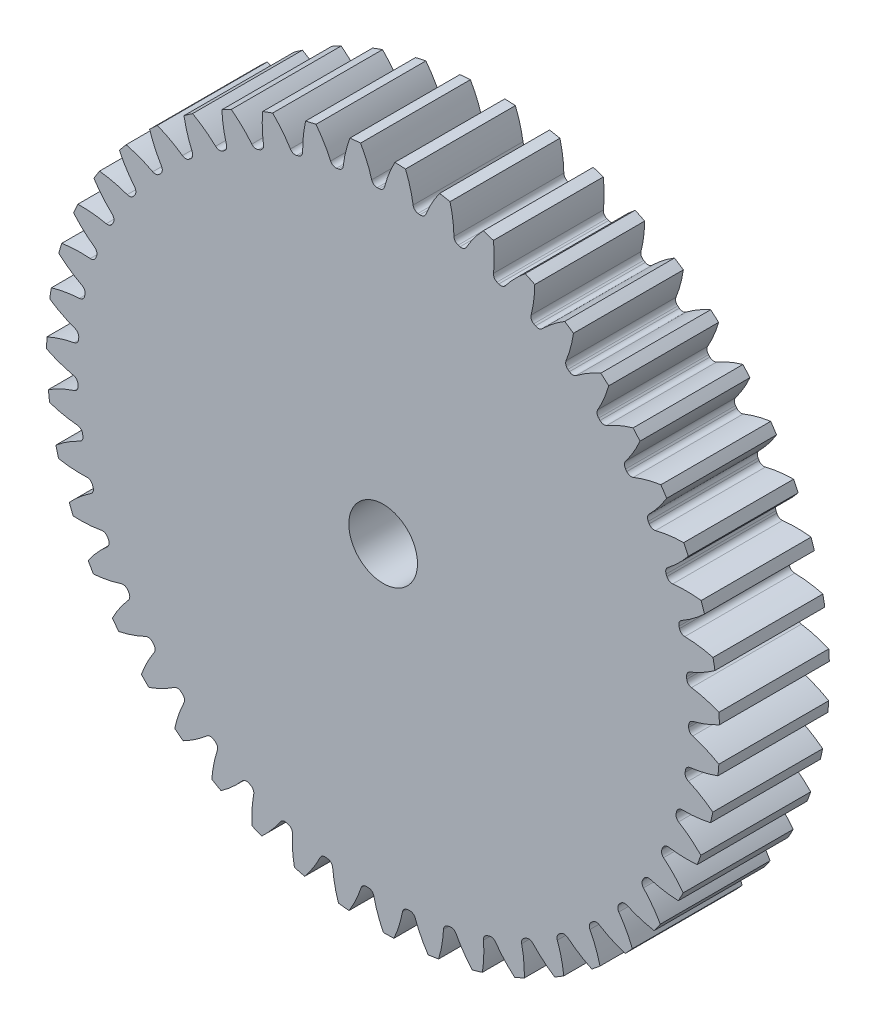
from build123d import *

# Parameters (mm, degrees)
SKETCH3_R         = 311.15
GEARBODY_DEPTH    = 101.6
TOOTHCUT_DEPTH    = 452.609571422
CIRPATTERN1_COUNT = 47
BOREDIA_R         = 31.75
BORE_DEPTH        = 12700


with BuildPart() as part:
    # Sketch3 → gearBody (new body)
    with BuildSketch(Plane.XY):
        Circle(SKETCH3_R)
    extrude(amount=GEARBODY_DEPTH)

    # Sketch2 → toothCut (cut, through all)
    with BuildSketch(Plane.XY):
        with BuildLine():
            ThreePointArc((282.515911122, -5.778458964), (282.5329999, -4.871816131), (282.547179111, -3.965123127))
            ThreePointArc((282.547179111, -3.965123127), (283.653402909, -0.841355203), (286.429292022, 0.968643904))
            ThreePointArc((286.429292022, 0.968643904), (299.082694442, 5.050752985), (311.15, 10.632181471))
            ThreePointArc((311.15, 10.632181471), (311.28532671, -5.367602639), (310.598464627, -21.353209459))
            ThreePointArc((310.598464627, -21.353209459), (298.730760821, -15.359061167), (286.225617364, -10.843134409))
            ThreePointArc((286.225617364, -10.843134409), (283.513780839, -8.938508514), (282.515911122, -5.778458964))
        make_face()
    toothcut = extrude(amount=TOOTHCUT_DEPTH, mode=Mode.SUBTRACT)

    # CirPattern1: toothCut ×47 about axis
    cirpattern1_axis = Axis((0, 0, 0), (0, 0, 1))
    for i in range(1, CIRPATTERN1_COUNT):
        add(toothcut.rotate(cirpattern1_axis, i * 360 / CIRPATTERN1_COUNT), mode=Mode.SUBTRACT)

    # boreDia → bore (cut, symmetric)
    with BuildSketch(Plane.XY):
        Circle(BOREDIA_R)
    extrude(amount=BORE_DEPTH, both=True, mode=Mode.SUBTRACT)


solid = part.part
